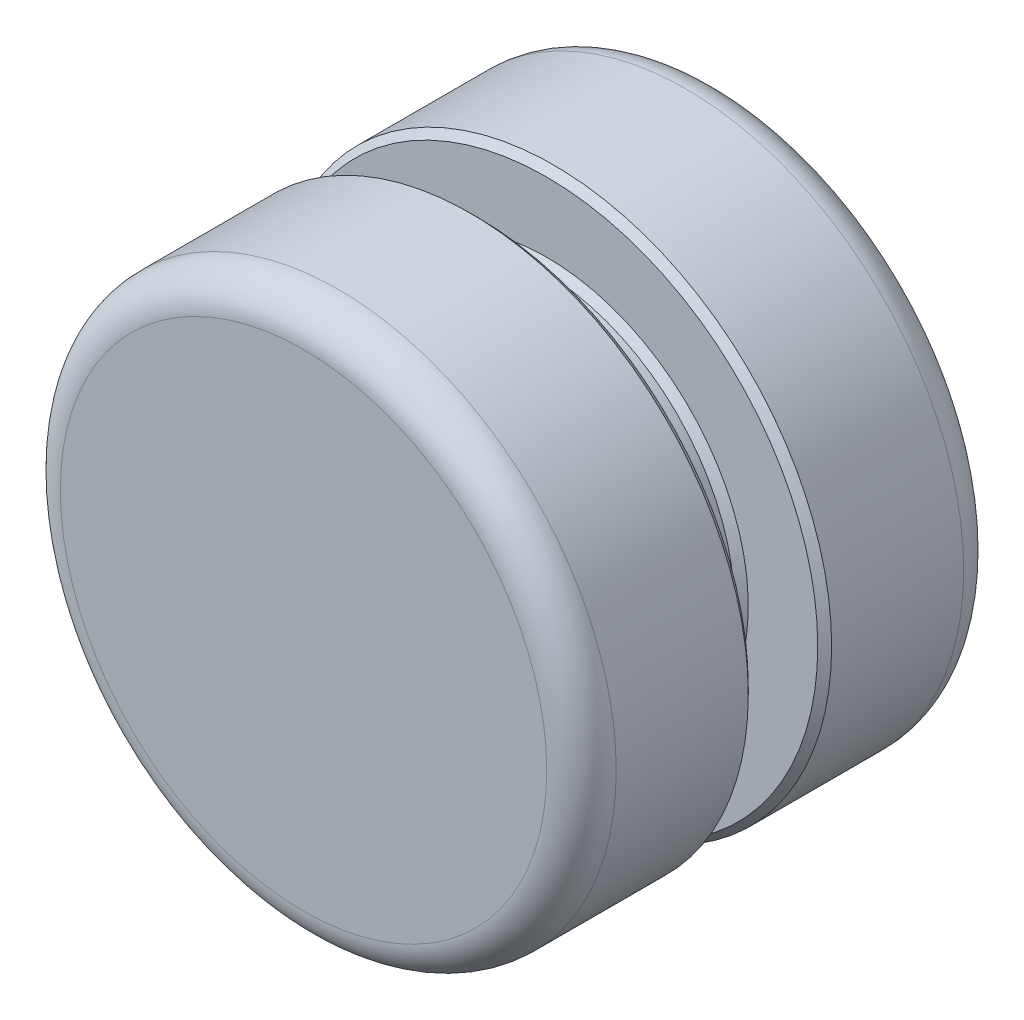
from build123d import *

# Parameters (mm, degrees)
SKETCH_1_R      = 2.8
EXTRUDE_1_DEPTH = 0.5
SKETCH_2_R      = 4
EXTRUDE_2_DEPTH = 2.5
FILLET_1_R      = 0.5
CHAMFER_1_SIZE  = 0.1


with BuildPart() as part:
    # Sketch 1 → Extrude 1 (new body)
    with BuildSketch(Plane.XY):
        Circle(SKETCH_1_R)
    extrude(amount=EXTRUDE_1_DEPTH)

    # Sketch 2 → Extrude 2 (add)
    with BuildSketch(Plane.XY.offset(0.5)):
        Circle(SKETCH_2_R)
    extrude(amount=EXTRUDE_2_DEPTH)

    # Mirror 1: part across plane


with BuildPart() as part_1:
    add(part.part)
    add(part.part.mirror(Plane.XY))

    # Fillet 1
    fillet_1_edges = [part_1.edges().sort_by_distance(p)[0] for p in [
        (-4, 0, -3),
        (-4, 0, 3),
    ]]
    fillet(fillet_1_edges, radius=FILLET_1_R)

    # Chamfer 1
    chamfer_1_edges = [part_1.edges().sort_by_distance(p)[0] for p in [
        (-2.8, 0, -0.5),
        (-4, 0, -0.5),
        (-2.8, 0, 0.5),
        (-4, 0, 0.5),
    ]]
    chamfer(chamfer_1_edges, length=CHAMFER_1_SIZE)


solid = part_1.part
